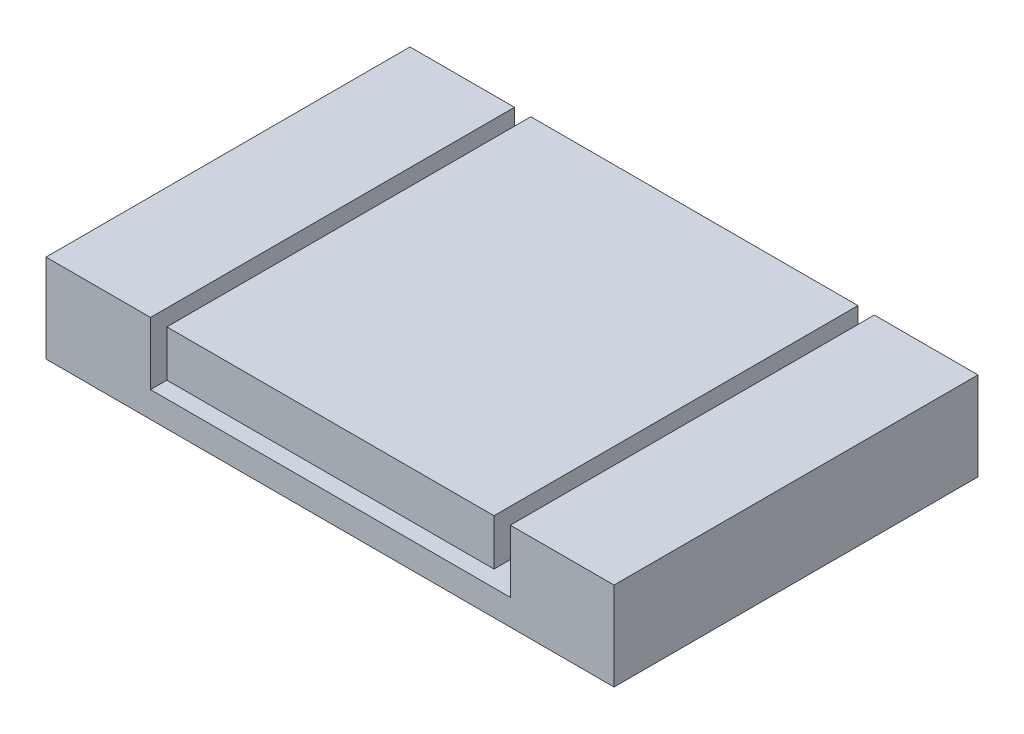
ISO-10303-21;
HEADER;
FILE_DESCRIPTION(('STEP AP214'),'2;1');
FILE_NAME('part.step','',(''),(''),'','','');
FILE_SCHEMA(('AUTOMOTIVE_DESIGN { 1 0 10303 214 1 1 1 1 }'));
ENDSEC;
DATA;
#1=APPLICATION_CONTEXT('core data for automotive mechanical design processes');
#2=APPLICATION_PROTOCOL_DEFINITION('international standard','automotive_design',2000,#1);
#3=PRODUCT_CONTEXT('',#1,'mechanical');
#4=PRODUCT('Part','Part','',(#3));
#5=PRODUCT_RELATED_PRODUCT_CATEGORY('part','',(#4));
#6=PRODUCT_DEFINITION_FORMATION('','',#4);
#7=PRODUCT_DEFINITION_CONTEXT('part definition',#1,'design');
#8=PRODUCT_DEFINITION('design','',#6,#7);
#9=PRODUCT_DEFINITION_SHAPE('','',#8);
#10=(LENGTH_UNIT() NAMED_UNIT(*) SI_UNIT(.MILLI.,.METRE.));
#11=(NAMED_UNIT(*) PLANE_ANGLE_UNIT() SI_UNIT($,.RADIAN.));
#12=(NAMED_UNIT(*) SI_UNIT($,.STERADIAN.) SOLID_ANGLE_UNIT());
#13=UNCERTAINTY_MEASURE_WITH_UNIT(LENGTH_MEASURE(1.E-05),#10,'distance_accuracy_value','');
#14=(GEOMETRIC_REPRESENTATION_CONTEXT(3) GLOBAL_UNCERTAINTY_ASSIGNED_CONTEXT((#13)) GLOBAL_UNIT_ASSIGNED_CONTEXT((#10,
#11,#12)) REPRESENTATION_CONTEXT('',''));
#15=CARTESIAN_POINT('',(0.,0.,0.));
#16=DIRECTION('',(0.,0.,1.));
#17=DIRECTION('',(1.,0.,0.));
#18=AXIS2_PLACEMENT_3D('',#15,#16,#17);
#19=CARTESIAN_POINT('',(-86.7956107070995,27.,55.6146576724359));
#20=DIRECTION('',(0.,1.,0.));
#21=DIRECTION('',(0.,0.,1.));
#22=AXIS2_PLACEMENT_3D('',#19,#20,#21);
#23=PLANE('',#22);
#24=DIRECTION('',(0.,0.,1.));
#25=VECTOR('',#24,1.);
#26=CARTESIAN_POINT('',(-54.8523030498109,27.,55.6146576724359));
#27=LINE('',#26,#25);
#28=CARTESIAN_POINT('',(-54.8523030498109,27.,-55.6146576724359));
#29=VERTEX_POINT('',#28);
#30=CARTESIAN_POINT('',(-54.8523030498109,27.,55.6146576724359));
#31=VERTEX_POINT('',#30);
#32=EDGE_CURVE('E137',#29,#31,#27,.T.);
#33=ORIENTED_EDGE('',*,*,#32,.F.);
#34=DIRECTION('',(-1.,0.,0.));
#35=VECTOR('',#34,1.);
#36=CARTESIAN_POINT('',(-86.7956107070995,27.,-55.6146576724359));
#37=LINE('',#36,#35);
#38=CARTESIAN_POINT('',(-86.7956107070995,27.,-55.6146576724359));
#39=VERTEX_POINT('',#38);
#40=EDGE_CURVE('E131',#29,#39,#37,.T.);
#41=ORIENTED_EDGE('',*,*,#40,.T.);
#42=DIRECTION('',(0.,0.,1.));
#43=VECTOR('',#42,1.);
#44=CARTESIAN_POINT('',(-86.7956107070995,27.,-55.6146576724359));
#45=LINE('',#44,#43);
#46=CARTESIAN_POINT('',(-86.7956107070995,27.,55.6146576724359));
#47=VERTEX_POINT('',#46);
#48=EDGE_CURVE('E135',#39,#47,#45,.T.);
#49=ORIENTED_EDGE('',*,*,#48,.T.);
#50=DIRECTION('',(1.,0.,0.));
#51=VECTOR('',#50,1.);
#52=CARTESIAN_POINT('',(-86.7956107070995,27.,55.6146576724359));
#53=LINE('',#52,#51);
#54=EDGE_CURVE('E71',#47,#31,#53,.T.);
#55=ORIENTED_EDGE('',*,*,#54,.T.);
#56=EDGE_LOOP('',(#33,#41,#49,#55));
#57=FACE_BOUND('',#56,.T.);
#58=ADVANCED_FACE('F67',(#57),#23,.T.);
#59=CARTESIAN_POINT('',(-86.7956107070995,27.,-55.6146576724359));
#60=DIRECTION('',(1.,0.,0.));
#61=DIRECTION('',(0.,0.,-1.));
#62=AXIS2_PLACEMENT_3D('',#59,#60,#61);
#63=PLANE('',#62);
#64=DIRECTION('',(0.,0.,1.));
#65=VECTOR('',#64,1.);
#66=CARTESIAN_POINT('',(-86.7956107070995,0.,-55.6146576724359));
#67=LINE('',#66,#65);
#68=CARTESIAN_POINT('',(-86.7956107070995,0.,-55.6146576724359));
#69=VERTEX_POINT('',#68);
#70=CARTESIAN_POINT('',(-86.7956107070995,0.,55.6146576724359));
#71=VERTEX_POINT('',#70);
#72=EDGE_CURVE('E151',#69,#71,#67,.T.);
#73=ORIENTED_EDGE('',*,*,#72,.T.);
#74=DIRECTION('',(0.,-1.,0.));
#75=VECTOR('',#74,1.);
#76=CARTESIAN_POINT('',(-86.7956107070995,27.,55.6146576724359));
#77=LINE('',#76,#75);
#78=EDGE_CURVE('E150',#47,#71,#77,.T.);
#79=ORIENTED_EDGE('',*,*,#78,.F.);
#80=ORIENTED_EDGE('',*,*,#48,.F.);
#81=DIRECTION('',(0.,-1.,0.));
#82=VECTOR('',#81,1.);
#83=CARTESIAN_POINT('',(-86.7956107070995,27.,-55.6146576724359));
#84=LINE('',#83,#82);
#85=EDGE_CURVE('E142',#39,#69,#84,.T.);
#86=ORIENTED_EDGE('',*,*,#85,.T.);
#87=EDGE_LOOP('',(#73,#79,#80,#86));
#88=FACE_BOUND('',#87,.T.);
#89=ADVANCED_FACE('F153',(#88),#63,.F.);
#90=CARTESIAN_POINT('',(-86.7956107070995,27.,55.6146576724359));
#91=DIRECTION('',(0.,0.,-1.));
#92=DIRECTION('',(-1.,0.,0.));
#93=AXIS2_PLACEMENT_3D('',#90,#91,#92);
#94=PLANE('',#93);
#95=DIRECTION('',(1.,0.,0.));
#96=VECTOR('',#95,1.);
#97=CARTESIAN_POINT('',(-49.8523030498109,7.89347241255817,55.6146576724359));
#98=LINE('',#97,#96);
#99=CARTESIAN_POINT('',(-54.8523030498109,7.89347241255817,55.6146576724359));
#100=VERTEX_POINT('',#99);
#101=CARTESIAN_POINT('',(55.1092736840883,7.89347241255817,55.6146576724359));
#102=VERTEX_POINT('',#101);
#103=EDGE_CURVE('E77',#100,#102,#98,.T.);
#104=ORIENTED_EDGE('',*,*,#103,.F.);
#105=DIRECTION('',(0.,-1.,0.));
#106=VECTOR('',#105,1.);
#107=CARTESIAN_POINT('',(-54.8523030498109,39.5806862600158,55.6146576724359));
#108=LINE('',#107,#106);
#109=EDGE_CURVE('E173',#31,#100,#108,.T.);
#110=ORIENTED_EDGE('',*,*,#109,.F.);
#111=ORIENTED_EDGE('',*,*,#54,.F.);
#112=ORIENTED_EDGE('',*,*,#78,.T.);
#113=DIRECTION('',(1.,0.,0.));
#114=VECTOR('',#113,1.);
#115=CARTESIAN_POINT('',(-86.7956107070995,0.,55.6146576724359));
#116=LINE('',#115,#114);
#117=CARTESIAN_POINT('',(86.7956107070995,0.,55.6146576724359));
#118=VERTEX_POINT('',#117);
#119=EDGE_CURVE('E165',#71,#118,#116,.T.);
#120=ORIENTED_EDGE('',*,*,#119,.T.);
#121=DIRECTION('',(0.,-1.,0.));
#122=VECTOR('',#121,1.);
#123=CARTESIAN_POINT('',(86.7956107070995,27.,55.6146576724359));
#124=LINE('',#123,#122);
#125=CARTESIAN_POINT('',(86.7956107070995,27.,55.6146576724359));
#126=VERTEX_POINT('',#125);
#127=EDGE_CURVE('E164',#126,#118,#124,.T.);
#128=ORIENTED_EDGE('',*,*,#127,.F.);
#129=CARTESIAN_POINT('',(55.1092736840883,27.,55.6146576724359));
#130=VERTEX_POINT('',#129);
#131=EDGE_CURVE('E156',#130,#126,#53,.T.);
#132=ORIENTED_EDGE('',*,*,#131,.F.);
#133=DIRECTION('',(0.,1.,0.));
#134=VECTOR('',#133,1.);
#135=CARTESIAN_POINT('',(55.1092736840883,39.5806862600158,55.6146576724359));
#136=LINE('',#135,#134);
#137=EDGE_CURVE('E169',#102,#130,#136,.T.);
#138=ORIENTED_EDGE('',*,*,#137,.F.);
#139=EDGE_LOOP('',(#104,#110,#111,#112,#120,#128,#132,#138));
#140=FACE_BOUND('',#139,.T.);
#141=ADVANCED_FACE('F69',(#140),#94,.F.);
#142=CARTESIAN_POINT('',(86.7956107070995,27.,-55.6146576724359));
#143=DIRECTION('',(-1.,0.,0.));
#144=DIRECTION('',(0.,0.,1.));
#145=AXIS2_PLACEMENT_3D('',#142,#143,#144);
#146=PLANE('',#145);
#147=DIRECTION('',(0.,0.,-1.));
#148=VECTOR('',#147,1.);
#149=CARTESIAN_POINT('',(86.7956107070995,0.,-55.6146576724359));
#150=LINE('',#149,#148);
#151=CARTESIAN_POINT('',(86.7956107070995,0.,-55.6146576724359));
#152=VERTEX_POINT('',#151);
#153=EDGE_CURVE('E162',#118,#152,#150,.T.);
#154=ORIENTED_EDGE('',*,*,#153,.T.);
#155=DIRECTION('',(0.,-1.,0.));
#156=VECTOR('',#155,1.);
#157=CARTESIAN_POINT('',(86.7956107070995,27.,-55.6146576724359));
#158=LINE('',#157,#156);
#159=CARTESIAN_POINT('',(86.7956107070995,27.,-55.6146576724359));
#160=VERTEX_POINT('',#159);
#161=EDGE_CURVE('E161',#160,#152,#158,.T.);
#162=ORIENTED_EDGE('',*,*,#161,.F.);
#163=DIRECTION('',(0.,0.,-1.));
#164=VECTOR('',#163,1.);
#165=CARTESIAN_POINT('',(86.7956107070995,27.,-55.6146576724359));
#166=LINE('',#165,#164);
#167=EDGE_CURVE('E159',#126,#160,#166,.T.);
#168=ORIENTED_EDGE('',*,*,#167,.F.);
#169=ORIENTED_EDGE('',*,*,#127,.T.);
#170=EDGE_LOOP('',(#154,#162,#168,#169));
#171=FACE_BOUND('',#170,.T.);
#172=ADVANCED_FACE('F199',(#171),#146,.F.);
#173=CARTESIAN_POINT('',(-86.7956107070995,27.,-55.6146576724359));
#174=DIRECTION('',(0.,0.,1.));
#175=DIRECTION('',(1.,0.,0.));
#176=AXIS2_PLACEMENT_3D('',#173,#174,#175);
#177=PLANE('',#176);
#178=ORIENTED_EDGE('',*,*,#40,.F.);
#179=DIRECTION('',(0.,-1.,0.));
#180=VECTOR('',#179,1.);
#181=CARTESIAN_POINT('',(-54.8523030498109,39.5806862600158,-55.6146576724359));
#182=LINE('',#181,#180);
#183=CARTESIAN_POINT('',(-54.8523030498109,7.89347241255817,-55.6146576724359));
#184=VERTEX_POINT('',#183);
#185=EDGE_CURVE('E181',#29,#184,#182,.T.);
#186=ORIENTED_EDGE('',*,*,#185,.T.);
#187=DIRECTION('',(1.,0.,0.));
#188=VECTOR('',#187,1.);
#189=CARTESIAN_POINT('',(-49.8523030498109,7.89347241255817,-55.6146576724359));
#190=LINE('',#189,#188);
#191=CARTESIAN_POINT('',(55.1092736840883,7.89347241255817,-55.6146576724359));
#192=VERTEX_POINT('',#191);
#193=EDGE_CURVE('E178',#184,#192,#190,.T.);
#194=ORIENTED_EDGE('',*,*,#193,.T.);
#195=DIRECTION('',(0.,1.,0.));
#196=VECTOR('',#195,1.);
#197=CARTESIAN_POINT('',(55.1092736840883,39.5806862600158,-55.6146576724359));
#198=LINE('',#197,#196);
#199=CARTESIAN_POINT('',(55.1092736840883,27.,-55.6146576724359));
#200=VERTEX_POINT('',#199);
#201=EDGE_CURVE('E175',#192,#200,#198,.T.);
#202=ORIENTED_EDGE('',*,*,#201,.T.);
#203=EDGE_CURVE('E140',#160,#200,#37,.T.);
#204=ORIENTED_EDGE('',*,*,#203,.F.);
#205=ORIENTED_EDGE('',*,*,#161,.T.);
#206=DIRECTION('',(-1.,0.,0.));
#207=VECTOR('',#206,1.);
#208=CARTESIAN_POINT('',(-86.7956107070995,0.,-55.6146576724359));
#209=LINE('',#208,#207);
#210=EDGE_CURVE('E146',#152,#69,#209,.T.);
#211=ORIENTED_EDGE('',*,*,#210,.T.);
#212=ORIENTED_EDGE('',*,*,#85,.F.);
#213=EDGE_LOOP('',(#178,#186,#194,#202,#204,#205,#211,#212));
#214=FACE_BOUND('',#213,.T.);
#215=ADVANCED_FACE('F143',(#214),#177,.F.);
#216=DIRECTION('',(0.,0.,-1.));
#217=VECTOR('',#216,1.);
#218=CARTESIAN_POINT('',(55.1092736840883,27.,55.6146576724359));
#219=LINE('',#218,#217);
#220=EDGE_CURVE('E170',#130,#200,#219,.T.);
#221=ORIENTED_EDGE('',*,*,#220,.F.);
#222=ORIENTED_EDGE('',*,*,#131,.T.);
#223=ORIENTED_EDGE('',*,*,#167,.T.);
#224=ORIENTED_EDGE('',*,*,#203,.T.);
#225=EDGE_LOOP('',(#221,#222,#223,#224));
#226=FACE_BOUND('',#225,.T.);
#227=ADVANCED_FACE('F191',(#226),#23,.T.);
#228=CARTESIAN_POINT('',(-86.7956107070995,0.,55.6146576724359));
#229=DIRECTION('',(0.,1.,0.));
#230=DIRECTION('',(0.,0.,1.));
#231=AXIS2_PLACEMENT_3D('',#228,#229,#230);
#232=PLANE('',#231);
#233=ORIENTED_EDGE('',*,*,#72,.F.);
#234=ORIENTED_EDGE('',*,*,#210,.F.);
#235=ORIENTED_EDGE('',*,*,#153,.F.);
#236=ORIENTED_EDGE('',*,*,#119,.F.);
#237=EDGE_LOOP('',(#233,#234,#235,#236));
#238=FACE_BOUND('',#237,.T.);
#239=ADVANCED_FACE('F207',(#238),#232,.F.);
#240=CARTESIAN_POINT('',(-54.8523030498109,39.5806862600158,-55.6146576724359));
#241=DIRECTION('',(-1.,0.,0.));
#242=DIRECTION('',(0.,0.,1.));
#243=AXIS2_PLACEMENT_3D('',#240,#241,#242);
#244=PLANE('',#243);
#245=ORIENTED_EDGE('',*,*,#32,.T.);
#246=ORIENTED_EDGE('',*,*,#109,.T.);
#247=DIRECTION('',(0.,0.,1.));
#248=VECTOR('',#247,1.);
#249=CARTESIAN_POINT('',(-54.8523030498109,7.89347241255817,-55.6146576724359));
#250=LINE('',#249,#248);
#251=EDGE_CURVE('E13',#184,#100,#250,.T.);
#252=ORIENTED_EDGE('',*,*,#251,.F.);
#253=ORIENTED_EDGE('',*,*,#185,.F.);
#254=EDGE_LOOP('',(#245,#246,#252,#253));
#255=FACE_BOUND('',#254,.T.);
#256=ADVANCED_FACE('F209',(#255),#244,.F.);
#257=CARTESIAN_POINT('',(55.1092736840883,39.5806862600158,-55.6146576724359));
#258=DIRECTION('',(1.,0.,0.));
#259=DIRECTION('',(0.,0.,-1.));
#260=AXIS2_PLACEMENT_3D('',#257,#258,#259);
#261=PLANE('',#260);
#262=ORIENTED_EDGE('',*,*,#220,.T.);
#263=ORIENTED_EDGE('',*,*,#201,.F.);
#264=DIRECTION('',(0.,0.,1.));
#265=VECTOR('',#264,1.);
#266=CARTESIAN_POINT('',(55.1092736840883,7.89347241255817,-55.6146576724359));
#267=LINE('',#266,#265);
#268=EDGE_CURVE('E85',#192,#102,#267,.T.);
#269=ORIENTED_EDGE('',*,*,#268,.T.);
#270=ORIENTED_EDGE('',*,*,#137,.T.);
#271=EDGE_LOOP('',(#262,#263,#269,#270));
#272=FACE_BOUND('',#271,.T.);
#273=ADVANCED_FACE('F202',(#272),#261,.F.);
#274=CARTESIAN_POINT('',(-49.8523030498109,7.89347241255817,-55.6146576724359));
#275=DIRECTION('',(0.,-1.,0.));
#276=DIRECTION('',(0.,0.,-1.));
#277=AXIS2_PLACEMENT_3D('',#274,#275,#276);
#278=PLANE('',#277);
#279=ORIENTED_EDGE('',*,*,#103,.T.);
#280=ORIENTED_EDGE('',*,*,#268,.F.);
#281=ORIENTED_EDGE('',*,*,#193,.F.);
#282=ORIENTED_EDGE('',*,*,#251,.T.);
#283=EDGE_LOOP('',(#279,#280,#281,#282));
#284=FACE_BOUND('',#283,.T.);
#285=ADVANCED_FACE('F277',(#284),#278,.F.);
#286=CLOSED_SHELL('',(#58,#89,#141,#172,#215,#227,#239,#256,#273,#285));
#287=MANIFOLD_SOLID_BREP('B2',#286);
#288=CARTESIAN_POINT('',(-86.7956107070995,27.,55.6146576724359));
#289=DIRECTION('',(0.,1.,0.));
#290=DIRECTION('',(0.,0.,1.));
#291=AXIS2_PLACEMENT_3D('',#288,#289,#290);
#292=PLANE('',#291);
#293=DIRECTION('',(-1.,0.,0.));
#294=VECTOR('',#293,1.);
#295=CARTESIAN_POINT('',(-86.7956107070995,27.,-55.6146576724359));
#296=LINE('',#295,#294);
#297=CARTESIAN_POINT('',(50.1092736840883,27.,-55.6146576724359));
#298=VERTEX_POINT('',#297);
#299=CARTESIAN_POINT('',(-49.8523030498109,27.,-55.6146576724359));
#300=VERTEX_POINT('',#299);
#301=EDGE_CURVE('E361',#298,#300,#296,.T.);
#302=ORIENTED_EDGE('',*,*,#301,.T.);
#303=DIRECTION('',(0.,0.,1.));
#304=VECTOR('',#303,1.);
#305=CARTESIAN_POINT('',(-49.8523030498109,27.,55.6146576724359));
#306=LINE('',#305,#304);
#307=CARTESIAN_POINT('',(-49.8523030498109,27.,55.6146576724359));
#308=VERTEX_POINT('',#307);
#309=EDGE_CURVE('E65',#300,#308,#306,.T.);
#310=ORIENTED_EDGE('',*,*,#309,.T.);
#311=DIRECTION('',(1.,0.,0.));
#312=VECTOR('',#311,1.);
#313=CARTESIAN_POINT('',(-86.7956107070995,27.,55.6146576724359));
#314=LINE('',#313,#312);
#315=CARTESIAN_POINT('',(50.1092736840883,27.,55.6146576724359));
#316=VERTEX_POINT('',#315);
#317=EDGE_CURVE('E357',#308,#316,#314,.T.);
#318=ORIENTED_EDGE('',*,*,#317,.T.);
#319=DIRECTION('',(0.,0.,-1.));
#320=VECTOR('',#319,1.);
#321=CARTESIAN_POINT('',(50.1092736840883,27.,55.6146576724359));
#322=LINE('',#321,#320);
#323=EDGE_CURVE('E300',#316,#298,#322,.T.);
#324=ORIENTED_EDGE('',*,*,#323,.T.);
#325=EDGE_LOOP('',(#302,#310,#318,#324));
#326=FACE_BOUND('',#325,.T.);
#327=ADVANCED_FACE('F292',(#326),#292,.T.);
#328=CARTESIAN_POINT('',(-86.7956107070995,27.,-55.6146576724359));
#329=DIRECTION('',(0.,0.,1.));
#330=DIRECTION('',(1.,0.,0.));
#331=AXIS2_PLACEMENT_3D('',#328,#329,#330);
#332=PLANE('',#331);
#333=DIRECTION('',(0.,-1.,0.));
#334=VECTOR('',#333,1.);
#335=CARTESIAN_POINT('',(-49.8523030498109,39.5806862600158,-55.6146576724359));
#336=LINE('',#335,#334);
#337=CARTESIAN_POINT('',(-49.8523030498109,12.8934724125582,-55.6146576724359));
#338=VERTEX_POINT('',#337);
#339=EDGE_CURVE('E328',#300,#338,#336,.T.);
#340=ORIENTED_EDGE('',*,*,#339,.F.);
#341=ORIENTED_EDGE('',*,*,#301,.F.);
#342=DIRECTION('',(0.,1.,0.));
#343=VECTOR('',#342,1.);
#344=CARTESIAN_POINT('',(50.1092736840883,39.5806862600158,-55.6146576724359));
#345=LINE('',#344,#343);
#346=CARTESIAN_POINT('',(50.1092736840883,12.8934724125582,-55.6146576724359));
#347=VERTEX_POINT('',#346);
#348=EDGE_CURVE('E307',#347,#298,#345,.T.);
#349=ORIENTED_EDGE('',*,*,#348,.F.);
#350=DIRECTION('',(1.,0.,0.));
#351=VECTOR('',#350,1.);
#352=CARTESIAN_POINT('',(-49.8523030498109,12.8934724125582,-55.6146576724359));
#353=LINE('',#352,#351);
#354=EDGE_CURVE('E337',#338,#347,#353,.T.);
#355=ORIENTED_EDGE('',*,*,#354,.F.);
#356=EDGE_LOOP('',(#340,#341,#349,#355));
#357=FACE_BOUND('',#356,.T.);
#358=ADVANCED_FACE('F348',(#357),#332,.F.);
#359=CARTESIAN_POINT('',(-86.7956107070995,27.,55.6146576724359));
#360=DIRECTION('',(0.,0.,-1.));
#361=DIRECTION('',(-1.,0.,0.));
#362=AXIS2_PLACEMENT_3D('',#359,#360,#361);
#363=PLANE('',#362);
#364=DIRECTION('',(0.,-1.,0.));
#365=VECTOR('',#364,1.);
#366=CARTESIAN_POINT('',(-49.8523030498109,39.5806862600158,55.6146576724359));
#367=LINE('',#366,#365);
#368=CARTESIAN_POINT('',(-49.8523030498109,12.8934724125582,55.6146576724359));
#369=VERTEX_POINT('',#368);
#370=EDGE_CURVE('E352',#308,#369,#367,.T.);
#371=ORIENTED_EDGE('',*,*,#370,.T.);
#372=DIRECTION('',(1.,0.,0.));
#373=VECTOR('',#372,1.);
#374=CARTESIAN_POINT('',(-49.8523030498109,12.8934724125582,55.6146576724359));
#375=LINE('',#374,#373);
#376=CARTESIAN_POINT('',(50.1092736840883,12.8934724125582,55.6146576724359));
#377=VERTEX_POINT('',#376);
#378=EDGE_CURVE('E344',#369,#377,#375,.T.);
#379=ORIENTED_EDGE('',*,*,#378,.T.);
#380=DIRECTION('',(0.,1.,0.));
#381=VECTOR('',#380,1.);
#382=CARTESIAN_POINT('',(50.1092736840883,39.5806862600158,55.6146576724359));
#383=LINE('',#382,#381);
#384=EDGE_CURVE('E338',#377,#316,#383,.T.);
#385=ORIENTED_EDGE('',*,*,#384,.T.);
#386=ORIENTED_EDGE('',*,*,#317,.F.);
#387=EDGE_LOOP('',(#371,#379,#385,#386));
#388=FACE_BOUND('',#387,.T.);
#389=ADVANCED_FACE('F294',(#388),#363,.F.);
#390=CARTESIAN_POINT('',(-49.8523030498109,39.5806862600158,-55.6146576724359));
#391=DIRECTION('',(-1.,0.,0.));
#392=DIRECTION('',(0.,0.,1.));
#393=AXIS2_PLACEMENT_3D('',#390,#391,#392);
#394=PLANE('',#393);
#395=ORIENTED_EDGE('',*,*,#339,.T.);
#396=DIRECTION('',(0.,0.,1.));
#397=VECTOR('',#396,1.);
#398=CARTESIAN_POINT('',(-49.8523030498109,12.8934724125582,-55.6146576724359));
#399=LINE('',#398,#397);
#400=EDGE_CURVE('E331',#338,#369,#399,.T.);
#401=ORIENTED_EDGE('',*,*,#400,.T.);
#402=ORIENTED_EDGE('',*,*,#370,.F.);
#403=ORIENTED_EDGE('',*,*,#309,.F.);
#404=EDGE_LOOP('',(#395,#401,#402,#403));
#405=FACE_BOUND('',#404,.T.);
#406=ADVANCED_FACE('F330',(#405),#394,.T.);
#407=CARTESIAN_POINT('',(50.1092736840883,39.5806862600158,-55.6146576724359));
#408=DIRECTION('',(1.,0.,0.));
#409=DIRECTION('',(0.,0.,-1.));
#410=AXIS2_PLACEMENT_3D('',#407,#408,#409);
#411=PLANE('',#410);
#412=ORIENTED_EDGE('',*,*,#384,.F.);
#413=DIRECTION('',(0.,0.,1.));
#414=VECTOR('',#413,1.);
#415=CARTESIAN_POINT('',(50.1092736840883,12.8934724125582,-55.6146576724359));
#416=LINE('',#415,#414);
#417=EDGE_CURVE('E346',#347,#377,#416,.T.);
#418=ORIENTED_EDGE('',*,*,#417,.F.);
#419=ORIENTED_EDGE('',*,*,#348,.T.);
#420=ORIENTED_EDGE('',*,*,#323,.F.);
#421=EDGE_LOOP('',(#412,#418,#419,#420));
#422=FACE_BOUND('',#421,.T.);
#423=ADVANCED_FACE('F365',(#422),#411,.T.);
#424=CARTESIAN_POINT('',(-49.8523030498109,12.8934724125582,-55.6146576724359));
#425=DIRECTION('',(0.,-1.,0.));
#426=DIRECTION('',(0.,0.,-1.));
#427=AXIS2_PLACEMENT_3D('',#424,#425,#426);
#428=PLANE('',#427);
#429=ORIENTED_EDGE('',*,*,#378,.F.);
#430=ORIENTED_EDGE('',*,*,#400,.F.);
#431=ORIENTED_EDGE('',*,*,#354,.T.);
#432=ORIENTED_EDGE('',*,*,#417,.T.);
#433=EDGE_LOOP('',(#429,#430,#431,#432));
#434=FACE_BOUND('',#433,.T.);
#435=ADVANCED_FACE('F342',(#434),#428,.T.);
#436=CLOSED_SHELL('',(#327,#358,#389,#406,#423,#435));
#437=MANIFOLD_SOLID_BREP('B7',#436);
#438=ADVANCED_BREP_SHAPE_REPRESENTATION('',(#18,#287,#437),#14);
#439=SHAPE_DEFINITION_REPRESENTATION(#9,#438);
ENDSEC;
END-ISO-10303-21;
